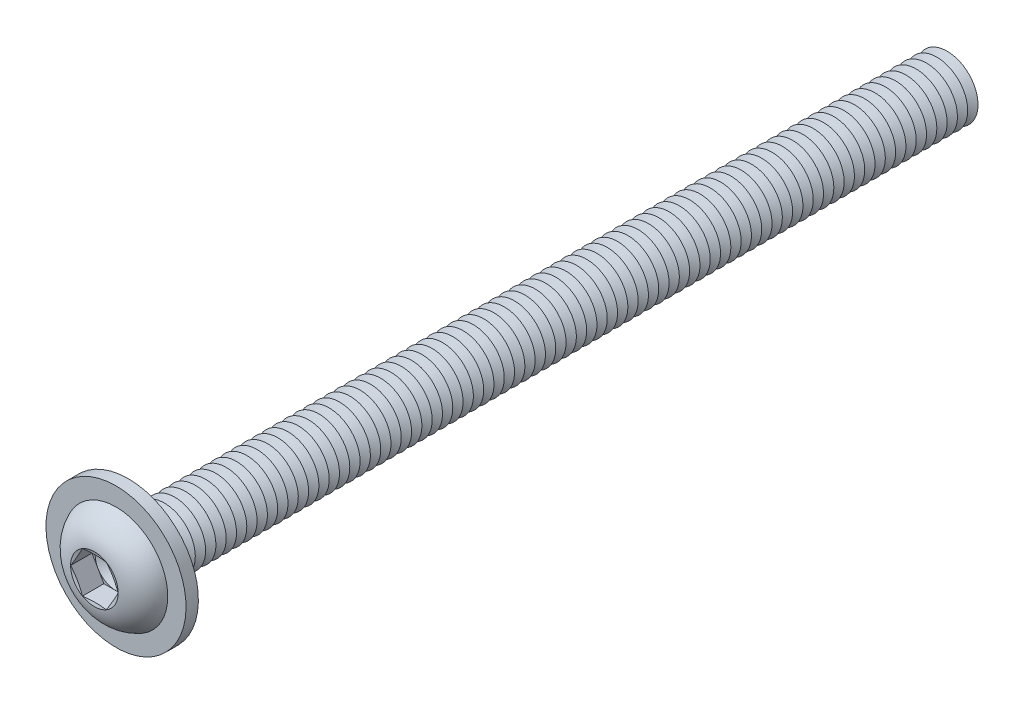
from build123d import *

# Parameters (mm, degrees)
FILLET1_R           = 0.5
LPATTERN1_COUNT     = 80
LPATTERN1_PITCH     = 1
CUT_EXTRUDE1_DEPTH  = 2.08
SKETCH5_R           = 6.8
SKETCH5_R_2         = 3.5
BOSS_EXTRUDE1_DEPTH = 1.2


with BuildPart() as part:
    # Sketch1 → Revolve1 (revolve)
    with BuildSketch(Plane(origin=(0, 0, 0), x_dir=(0, 0, -1), z_dir=(1, 0, 0))):
        with BuildLine():
            Line((0, 3), (0, 5.25))
            ThreePointArc((0, 5.25), (-2.210041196, 4.408189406), (-3.3, 2.3094))
            Line((-3.3, 2.3094), (-2.990599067, 1.1547))
            Line((-2.990599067, 1.1547), (-3.3, 1.1547))
            Line((-3.3, 1.1547), (-3.3, 0))
            Line((-3.3, 0), (80, 0))
            Line((80, 0), (80, 3))
            Line((80, 3), (0, 3))
        make_face()
    revolve(axis=Axis((0, 0, -80), (0, 0, 1)))

    # Fillet1
    fillet1_edges = [part.edges().sort_by_distance(p)[0] for p in [
        (0, -3, 0),
    ]]
    fillet(fillet1_edges, radius=FILLET1_R)

    # Sketch2 → Cut-Revolve1 (revolve, cut)
    with BuildSketch(Plane(origin=(0, 0, 0), x_dir=(0, 0, -1), z_dir=(1, 0, 0))):
        Polygon((79.5, 3), (80.5, 3), (80, 2.133974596), align=None)
    cut_revolve1 = revolve(axis=Axis((0, 0, -80), (0, 0, -1)), mode=Mode.SUBTRACT)

    # LPattern1: Cut-Revolve1 ×80
    with Locations(*[(0, 0, i * LPATTERN1_PITCH) for i in range(1, LPATTERN1_COUNT)]):
        add(cut_revolve1, mode=Mode.SUBTRACT)

    # Sketch3 → Cut-Extrude1 (cut)
    with BuildSketch(Plane.XY.offset(3.3)):
        Polygon((1.1547, 1.999999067), (-1.1547, 1.999999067), (-2.3094, 0), (-1.1547, -1.999999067), (1.1547, -1.999999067), (2.3094, 0), align=None)
    extrude(amount=-CUT_EXTRUDE1_DEPTH, mode=Mode.SUBTRACT)

    # Cut-Extrude2 cone 1 section (on through the dimple's axis) → Cut-Extrude2 (revolve, cut)
    with BuildSketch(Plane(origin=(0, 0, 1.22), x_dir=(0, -1, 0), z_dir=(1, 0, 0))):
        Polygon((0, 0), (1.999999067, 0), (0, 1.1547), align=None)
    revolve(axis=Axis((0, 0, 1.22), (0, 0, -1)), mode=Mode.SUBTRACT)

    # Sketch5 → Boss-Extrude1 (add)
    with BuildSketch(Plane(origin=(0, 0, 0), x_dir=(-1, 0, 0), z_dir=(0, 0, -1))):
        with Locations(Location((0, 0, 0), (0, 0, 90))):
            Circle(SKETCH5_R)
        Circle(SKETCH5_R_2, mode=Mode.SUBTRACT)
    extrude(amount=-BOSS_EXTRUDE1_DEPTH)


solid = part.part
